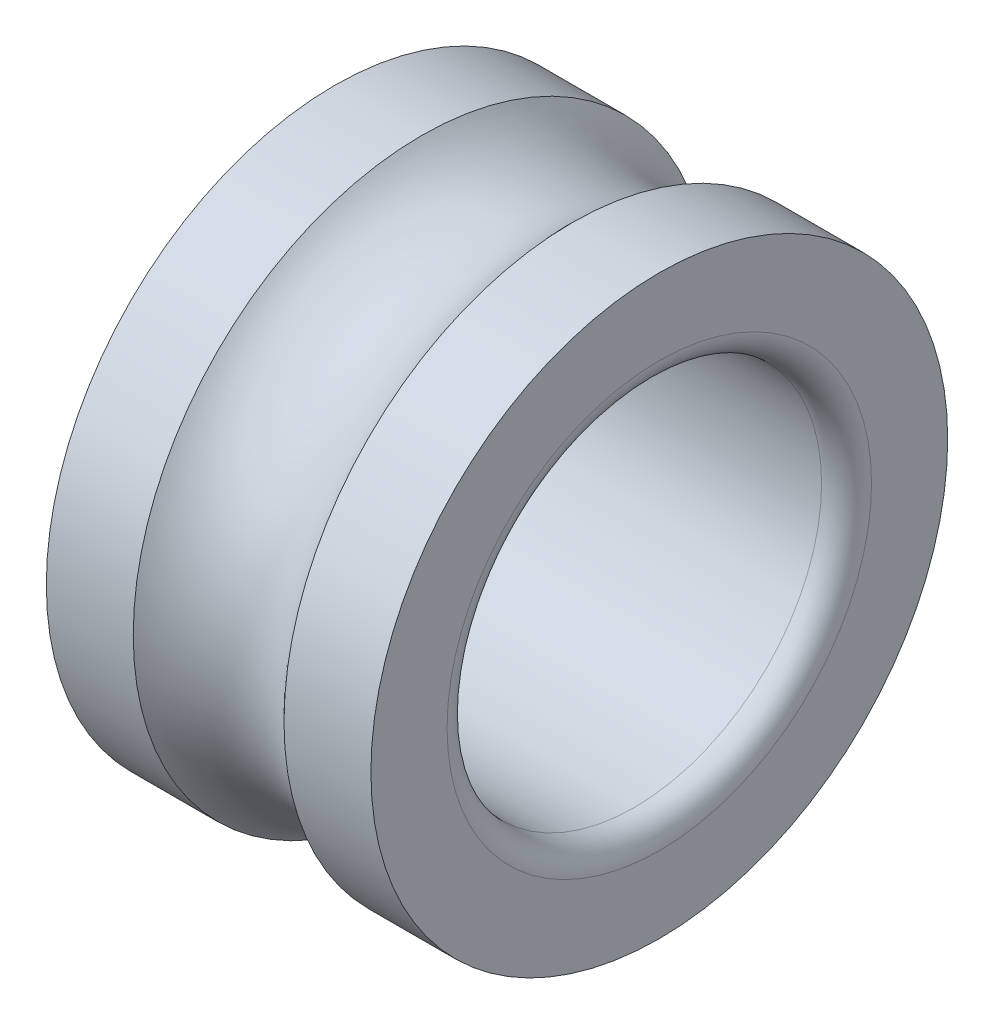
from build123d import *


with BuildPart() as part:
    # Esquisse1 → R_volution1 (revolve)
    with BuildSketch(Plane.XY, mode=Mode.PRIVATE) as r_volution1_sk:
        with BuildLine():
            Line((1, 7.5), (12, 7.5))
            ThreePointArc((12, 7.5), (12.707106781, 7.792893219), (13, 8.5))
            Line((13, 8.5), (13, 11.55))
            Line((13, 11.55), (9.51869177, 11.55))
            ThreePointArc((9.51869177, 11.55), (6.5, 10.2), (3.48130823, 11.55))
            Line((3.48130823, 11.55), (0, 11.55))
            Line((0, 11.55), (0, 8.5))
            ThreePointArc((0, 8.5), (0.292893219, 7.792893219), (1, 7.5))
        make_face()
    revolve(r_volution1_sk.sketch.rotate(Axis((0, 0, 0), (1, 0, 0)), 180), axis=Axis((0, 0, 0), (1, 0, 0)))


solid = part.part
